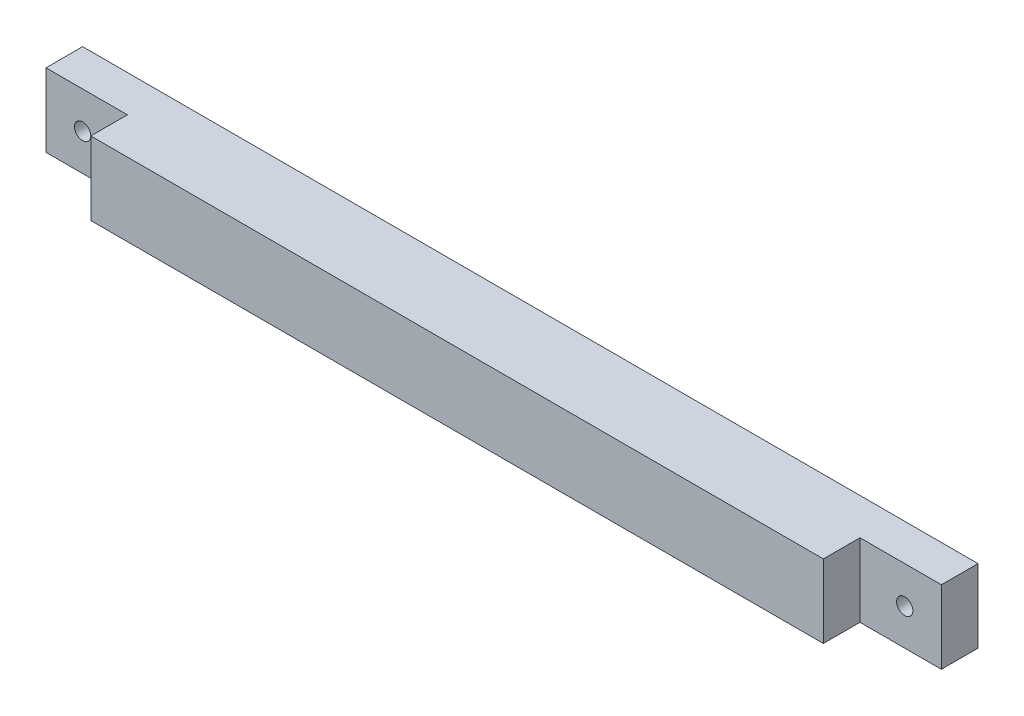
ISO-10303-21;
HEADER;
FILE_DESCRIPTION(('STEP AP214'),'2;1');
FILE_NAME('part.step','',(''),(''),'','','');
FILE_SCHEMA(('AUTOMOTIVE_DESIGN { 1 0 10303 214 1 1 1 1 }'));
ENDSEC;
DATA;
#1=APPLICATION_CONTEXT('core data for automotive mechanical design processes');
#2=APPLICATION_PROTOCOL_DEFINITION('international standard','automotive_design',2000,#1);
#3=PRODUCT_CONTEXT('',#1,'mechanical');
#4=PRODUCT('Part','Part','',(#3));
#5=PRODUCT_RELATED_PRODUCT_CATEGORY('part','',(#4));
#6=PRODUCT_DEFINITION_FORMATION('','',#4);
#7=PRODUCT_DEFINITION_CONTEXT('part definition',#1,'design');
#8=PRODUCT_DEFINITION('design','',#6,#7);
#9=PRODUCT_DEFINITION_SHAPE('','',#8);
#10=(LENGTH_UNIT() NAMED_UNIT(*) SI_UNIT(.MILLI.,.METRE.));
#11=(NAMED_UNIT(*) PLANE_ANGLE_UNIT() SI_UNIT($,.RADIAN.));
#12=(NAMED_UNIT(*) SI_UNIT($,.STERADIAN.) SOLID_ANGLE_UNIT());
#13=UNCERTAINTY_MEASURE_WITH_UNIT(LENGTH_MEASURE(1.E-05),#10,'distance_accuracy_value','');
#14=(GEOMETRIC_REPRESENTATION_CONTEXT(3) GLOBAL_UNCERTAINTY_ASSIGNED_CONTEXT((#13)) GLOBAL_UNIT_ASSIGNED_CONTEXT((#10,
#11,#12)) REPRESENTATION_CONTEXT('',''));
#15=CARTESIAN_POINT('',(0.,0.,0.));
#16=DIRECTION('',(0.,0.,1.));
#17=DIRECTION('',(1.,0.,0.));
#18=AXIS2_PLACEMENT_3D('',#15,#16,#17);
#19=CARTESIAN_POINT('',(42.7283154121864,-109.617562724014,9.));
#20=DIRECTION('',(-1.,0.,0.));
#21=DIRECTION('',(0.,0.,1.));
#22=AXIS2_PLACEMENT_3D('',#19,#20,#21);
#23=PLANE('',#22);
#24=DIRECTION('',(0.,1.,0.));
#25=VECTOR('',#24,1.);
#26=CARTESIAN_POINT('',(42.7283154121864,-109.617562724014,4.5));
#27=LINE('',#26,#25);
#28=CARTESIAN_POINT('',(42.7283154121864,-109.617562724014,4.5));
#29=VERTEX_POINT('',#28);
#30=CARTESIAN_POINT('',(42.7283154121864,-100.617562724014,4.5));
#31=VERTEX_POINT('',#30);
#32=EDGE_CURVE('E95',#29,#31,#27,.T.);
#33=ORIENTED_EDGE('',*,*,#32,.F.);
#34=DIRECTION('',(0.,0.,-1.));
#35=VECTOR('',#34,1.);
#36=CARTESIAN_POINT('',(42.7283154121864,-109.617562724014,9.));
#37=LINE('',#36,#35);
#38=CARTESIAN_POINT('',(42.7283154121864,-109.617562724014,0.));
#39=VERTEX_POINT('',#38);
#40=EDGE_CURVE('E38',#29,#39,#37,.T.);
#41=ORIENTED_EDGE('',*,*,#40,.T.);
#42=DIRECTION('',(0.,1.,0.));
#43=VECTOR('',#42,1.);
#44=CARTESIAN_POINT('',(42.7283154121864,-109.617562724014,0.));
#45=LINE('',#44,#43);
#46=CARTESIAN_POINT('',(42.7283154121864,-100.617562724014,0.));
#47=VERTEX_POINT('',#46);
#48=EDGE_CURVE('E116',#39,#47,#45,.T.);
#49=ORIENTED_EDGE('',*,*,#48,.T.);
#50=DIRECTION('',(0.,0.,-1.));
#51=VECTOR('',#50,1.);
#52=CARTESIAN_POINT('',(42.7283154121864,-100.617562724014,9.));
#53=LINE('',#52,#51);
#54=EDGE_CURVE('E111',#31,#47,#53,.T.);
#55=ORIENTED_EDGE('',*,*,#54,.F.);
#56=EDGE_LOOP('',(#33,#41,#49,#55));
#57=FACE_BOUND('',#56,.T.);
#58=ADVANCED_FACE('F30',(#57),#23,.F.);
#59=CARTESIAN_POINT('',(-67.2716845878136,-109.617562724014,9.));
#60=DIRECTION('',(1.,0.,0.));
#61=DIRECTION('',(0.,0.,-1.));
#62=AXIS2_PLACEMENT_3D('',#59,#60,#61);
#63=PLANE('',#62);
#64=DIRECTION('',(0.,0.,-1.));
#65=VECTOR('',#64,1.);
#66=CARTESIAN_POINT('',(-67.2716845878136,-109.617562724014,9.));
#67=LINE('',#66,#65);
#68=CARTESIAN_POINT('',(-67.2716845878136,-109.617562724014,4.5));
#69=VERTEX_POINT('',#68);
#70=CARTESIAN_POINT('',(-67.2716845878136,-109.617562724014,0.));
#71=VERTEX_POINT('',#70);
#72=EDGE_CURVE('E11',#69,#71,#67,.T.);
#73=ORIENTED_EDGE('',*,*,#72,.F.);
#74=DIRECTION('',(0.,-1.,0.));
#75=VECTOR('',#74,1.);
#76=CARTESIAN_POINT('',(-67.2716845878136,-109.617562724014,4.5));
#77=LINE('',#76,#75);
#78=CARTESIAN_POINT('',(-67.2716845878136,-100.617562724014,4.5));
#79=VERTEX_POINT('',#78);
#80=EDGE_CURVE('E143',#79,#69,#77,.T.);
#81=ORIENTED_EDGE('',*,*,#80,.F.);
#82=DIRECTION('',(0.,0.,-1.));
#83=VECTOR('',#82,1.);
#84=CARTESIAN_POINT('',(-67.2716845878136,-100.617562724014,9.));
#85=LINE('',#84,#83);
#86=CARTESIAN_POINT('',(-67.2716845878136,-100.617562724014,0.));
#87=VERTEX_POINT('',#86);
#88=EDGE_CURVE('E118',#79,#87,#85,.T.);
#89=ORIENTED_EDGE('',*,*,#88,.T.);
#90=DIRECTION('',(0.,-1.,0.));
#91=VECTOR('',#90,1.);
#92=CARTESIAN_POINT('',(-67.2716845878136,-109.617562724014,0.));
#93=LINE('',#92,#91);
#94=EDGE_CURVE('E130',#87,#71,#93,.T.);
#95=ORIENTED_EDGE('',*,*,#94,.T.);
#96=EDGE_LOOP('',(#73,#81,#89,#95));
#97=FACE_BOUND('',#96,.T.);
#98=ADVANCED_FACE('F32',(#97),#63,.F.);
#99=CARTESIAN_POINT('',(-67.2716845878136,-109.617562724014,9.));
#100=DIRECTION('',(0.,1.,0.));
#101=DIRECTION('',(0.,0.,1.));
#102=AXIS2_PLACEMENT_3D('',#99,#100,#101);
#103=PLANE('',#102);
#104=DIRECTION('',(1.,0.,0.));
#105=VECTOR('',#104,1.);
#106=CARTESIAN_POINT('',(42.7283154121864,-109.617562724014,4.5));
#107=LINE('',#106,#105);
#108=CARTESIAN_POINT('',(32.7283154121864,-109.617562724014,4.5));
#109=VERTEX_POINT('',#108);
#110=EDGE_CURVE('E101',#109,#29,#107,.T.);
#111=ORIENTED_EDGE('',*,*,#110,.F.);
#112=DIRECTION('',(0.,0.,1.));
#113=VECTOR('',#112,1.);
#114=CARTESIAN_POINT('',(32.7283154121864,-109.617562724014,4.5));
#115=LINE('',#114,#113);
#116=CARTESIAN_POINT('',(32.7283154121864,-109.617562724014,9.));
#117=VERTEX_POINT('',#116);
#118=EDGE_CURVE('E144',#109,#117,#115,.T.);
#119=ORIENTED_EDGE('',*,*,#118,.T.);
#120=DIRECTION('',(1.,0.,0.));
#121=VECTOR('',#120,1.);
#122=CARTESIAN_POINT('',(-67.2716845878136,-109.617562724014,9.));
#123=LINE('',#122,#121);
#124=CARTESIAN_POINT('',(-57.2716845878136,-109.617562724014,9.));
#125=VERTEX_POINT('',#124);
#126=EDGE_CURVE('E125',#125,#117,#123,.T.);
#127=ORIENTED_EDGE('',*,*,#126,.F.);
#128=DIRECTION('',(0.,0.,1.));
#129=VECTOR('',#128,1.);
#130=CARTESIAN_POINT('',(-57.2716845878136,-109.617562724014,4.5));
#131=LINE('',#130,#129);
#132=CARTESIAN_POINT('',(-57.2716845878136,-109.617562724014,4.5));
#133=VERTEX_POINT('',#132);
#134=EDGE_CURVE('E53',#133,#125,#131,.T.);
#135=ORIENTED_EDGE('',*,*,#134,.F.);
#136=DIRECTION('',(1.,0.,0.));
#137=VECTOR('',#136,1.);
#138=CARTESIAN_POINT('',(-67.2716845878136,-109.617562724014,4.5));
#139=LINE('',#138,#137);
#140=EDGE_CURVE('E149',#69,#133,#139,.T.);
#141=ORIENTED_EDGE('',*,*,#140,.F.);
#142=ORIENTED_EDGE('',*,*,#72,.T.);
#143=DIRECTION('',(1.,0.,0.));
#144=VECTOR('',#143,1.);
#145=CARTESIAN_POINT('',(-67.2716845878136,-109.617562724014,0.));
#146=LINE('',#145,#144);
#147=EDGE_CURVE('E127',#71,#39,#146,.T.);
#148=ORIENTED_EDGE('',*,*,#147,.T.);
#149=ORIENTED_EDGE('',*,*,#40,.F.);
#150=EDGE_LOOP('',(#111,#119,#127,#135,#141,#142,#148,#149));
#151=FACE_BOUND('',#150,.T.);
#152=ADVANCED_FACE('F195',(#151),#103,.F.);
#153=CARTESIAN_POINT('',(-67.2716845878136,-100.617562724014,9.));
#154=DIRECTION('',(0.,-1.,0.));
#155=DIRECTION('',(0.,0.,-1.));
#156=AXIS2_PLACEMENT_3D('',#153,#154,#155);
#157=PLANE('',#156);
#158=DIRECTION('',(-1.,0.,0.));
#159=VECTOR('',#158,1.);
#160=CARTESIAN_POINT('',(-67.2716845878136,-100.617562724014,9.));
#161=LINE('',#160,#159);
#162=CARTESIAN_POINT('',(32.7283154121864,-100.617562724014,9.));
#163=VERTEX_POINT('',#162);
#164=CARTESIAN_POINT('',(-57.2716845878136,-100.617562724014,9.));
#165=VERTEX_POINT('',#164);
#166=EDGE_CURVE('E120',#163,#165,#161,.T.);
#167=ORIENTED_EDGE('',*,*,#166,.F.);
#168=DIRECTION('',(0.,0.,1.));
#169=VECTOR('',#168,1.);
#170=CARTESIAN_POINT('',(32.7283154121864,-100.617562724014,4.5));
#171=LINE('',#170,#169);
#172=CARTESIAN_POINT('',(32.7283154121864,-100.617562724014,4.5));
#173=VERTEX_POINT('',#172);
#174=EDGE_CURVE('E45',#173,#163,#171,.T.);
#175=ORIENTED_EDGE('',*,*,#174,.F.);
#176=DIRECTION('',(-1.,0.,0.));
#177=VECTOR('',#176,1.);
#178=CARTESIAN_POINT('',(42.7283154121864,-100.617562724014,4.5));
#179=LINE('',#178,#177);
#180=EDGE_CURVE('E99',#31,#173,#179,.T.);
#181=ORIENTED_EDGE('',*,*,#180,.F.);
#182=ORIENTED_EDGE('',*,*,#54,.T.);
#183=DIRECTION('',(-1.,0.,0.));
#184=VECTOR('',#183,1.);
#185=CARTESIAN_POINT('',(-67.2716845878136,-100.617562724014,0.));
#186=LINE('',#185,#184);
#187=EDGE_CURVE('E123',#47,#87,#186,.T.);
#188=ORIENTED_EDGE('',*,*,#187,.T.);
#189=ORIENTED_EDGE('',*,*,#88,.F.);
#190=DIRECTION('',(-1.,0.,0.));
#191=VECTOR('',#190,1.);
#192=CARTESIAN_POINT('',(-67.2716845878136,-100.617562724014,4.5));
#193=LINE('',#192,#191);
#194=CARTESIAN_POINT('',(-57.2716845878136,-100.617562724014,4.5));
#195=VERTEX_POINT('',#194);
#196=EDGE_CURVE('E138',#195,#79,#193,.T.);
#197=ORIENTED_EDGE('',*,*,#196,.F.);
#198=DIRECTION('',(0.,0.,1.));
#199=VECTOR('',#198,1.);
#200=CARTESIAN_POINT('',(-57.2716845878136,-100.617562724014,4.5));
#201=LINE('',#200,#199);
#202=EDGE_CURVE('E133',#195,#165,#201,.T.);
#203=ORIENTED_EDGE('',*,*,#202,.T.);
#204=EDGE_LOOP('',(#167,#175,#181,#182,#188,#189,#197,#203));
#205=FACE_BOUND('',#204,.T.);
#206=ADVANCED_FACE('F109',(#205),#157,.F.);
#207=CARTESIAN_POINT('',(-67.2716845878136,-100.617562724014,9.));
#208=DIRECTION('',(0.,0.,-1.));
#209=DIRECTION('',(-1.,0.,0.));
#210=AXIS2_PLACEMENT_3D('',#207,#208,#209);
#211=PLANE('',#210);
#212=ORIENTED_EDGE('',*,*,#126,.T.);
#213=DIRECTION('',(0.,-1.,0.));
#214=VECTOR('',#213,1.);
#215=CARTESIAN_POINT('',(32.7283154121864,-109.617562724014,9.));
#216=LINE('',#215,#214);
#217=EDGE_CURVE('E105',#163,#117,#216,.T.);
#218=ORIENTED_EDGE('',*,*,#217,.F.);
#219=ORIENTED_EDGE('',*,*,#166,.T.);
#220=DIRECTION('',(0.,1.,0.));
#221=VECTOR('',#220,1.);
#222=CARTESIAN_POINT('',(-57.2716845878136,-109.617562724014,9.));
#223=LINE('',#222,#221);
#224=EDGE_CURVE('E141',#125,#165,#223,.T.);
#225=ORIENTED_EDGE('',*,*,#224,.F.);
#226=EDGE_LOOP('',(#212,#218,#219,#225));
#227=FACE_BOUND('',#226,.T.);
#228=ADVANCED_FACE('F201',(#227),#211,.F.);
#229=CARTESIAN_POINT('',(-67.2716845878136,-100.617562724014,0.));
#230=DIRECTION('',(0.,0.,-1.));
#231=DIRECTION('',(-1.,0.,0.));
#232=AXIS2_PLACEMENT_3D('',#229,#230,#231);
#233=PLANE('',#232);
#234=CARTESIAN_POINT('',(-62.7716845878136,-105.117562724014,0.));
#235=DIRECTION('',(0.,0.,1.));
#236=DIRECTION('',(1.,0.,0.));
#237=AXIS2_PLACEMENT_3D('',#234,#235,#236);
#238=CIRCLE('',#237,0.999999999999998);
#239=CARTESIAN_POINT('',(-61.7716845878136,-105.117562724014,0.));
#240=VERTEX_POINT('',#239);
#241=EDGE_CURVE('E163',#240,#240,#238,.T.);
#242=ORIENTED_EDGE('',*,*,#241,.T.);
#243=EDGE_LOOP('',(#242));
#244=FACE_BOUND('',#243,.T.);
#245=CARTESIAN_POINT('',(38.2284017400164,-105.145436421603,0.));
#246=DIRECTION('',(0.,0.,1.));
#247=DIRECTION('',(1.,0.,0.));
#248=AXIS2_PLACEMENT_3D('',#245,#246,#247);
#249=CIRCLE('',#248,0.999999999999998);
#250=CARTESIAN_POINT('',(39.2284017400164,-105.145436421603,0.));
#251=VERTEX_POINT('',#250);
#252=EDGE_CURVE('E157',#251,#251,#249,.T.);
#253=ORIENTED_EDGE('',*,*,#252,.T.);
#254=EDGE_LOOP('',(#253));
#255=FACE_BOUND('',#254,.T.);
#256=ORIENTED_EDGE('',*,*,#94,.F.);
#257=ORIENTED_EDGE('',*,*,#187,.F.);
#258=ORIENTED_EDGE('',*,*,#48,.F.);
#259=ORIENTED_EDGE('',*,*,#147,.F.);
#260=EDGE_LOOP('',(#256,#257,#258,#259));
#261=FACE_BOUND('',#260,.T.);
#262=ADVANCED_FACE('F172',(#244,#255,#261),#233,.T.);
#263=CARTESIAN_POINT('',(-57.2716845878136,-109.617562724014,4.5));
#264=DIRECTION('',(1.,0.,0.));
#265=DIRECTION('',(0.,1.,0.));
#266=AXIS2_PLACEMENT_3D('',#263,#264,#265);
#267=PLANE('',#266);
#268=ORIENTED_EDGE('',*,*,#224,.T.);
#269=ORIENTED_EDGE('',*,*,#202,.F.);
#270=DIRECTION('',(0.,1.,0.));
#271=VECTOR('',#270,1.);
#272=CARTESIAN_POINT('',(-57.2716845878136,-109.617562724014,4.5));
#273=LINE('',#272,#271);
#274=EDGE_CURVE('E146',#133,#195,#273,.T.);
#275=ORIENTED_EDGE('',*,*,#274,.F.);
#276=ORIENTED_EDGE('',*,*,#134,.T.);
#277=EDGE_LOOP('',(#268,#269,#275,#276));
#278=FACE_BOUND('',#277,.T.);
#279=ADVANCED_FACE('F186',(#278),#267,.F.);
#280=CARTESIAN_POINT('',(-67.2716845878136,-100.617562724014,4.5));
#281=DIRECTION('',(0.,0.,-1.));
#282=DIRECTION('',(-1.,0.,0.));
#283=AXIS2_PLACEMENT_3D('',#280,#281,#282);
#284=PLANE('',#283);
#285=CARTESIAN_POINT('',(-62.7716845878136,-105.117562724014,4.5));
#286=DIRECTION('',(0.,0.,1.));
#287=DIRECTION('',(1.,0.,0.));
#288=AXIS2_PLACEMENT_3D('',#285,#286,#287);
#289=CIRCLE('',#288,0.999999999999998);
#290=CARTESIAN_POINT('',(-61.7716845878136,-105.117562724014,4.5));
#291=VERTEX_POINT('',#290);
#292=EDGE_CURVE('E166',#291,#291,#289,.T.);
#293=ORIENTED_EDGE('',*,*,#292,.F.);
#294=EDGE_LOOP('',(#293));
#295=FACE_BOUND('',#294,.T.);
#296=ORIENTED_EDGE('',*,*,#80,.T.);
#297=ORIENTED_EDGE('',*,*,#140,.T.);
#298=ORIENTED_EDGE('',*,*,#274,.T.);
#299=ORIENTED_EDGE('',*,*,#196,.T.);
#300=EDGE_LOOP('',(#296,#297,#298,#299));
#301=FACE_BOUND('',#300,.T.);
#302=ADVANCED_FACE('F182',(#295,#301),#284,.F.);
#303=CARTESIAN_POINT('',(32.7283154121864,-109.617562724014,4.5));
#304=DIRECTION('',(-1.,0.,0.));
#305=DIRECTION('',(0.,0.,1.));
#306=AXIS2_PLACEMENT_3D('',#303,#304,#305);
#307=PLANE('',#306);
#308=ORIENTED_EDGE('',*,*,#217,.T.);
#309=ORIENTED_EDGE('',*,*,#118,.F.);
#310=DIRECTION('',(0.,-1.,0.));
#311=VECTOR('',#310,1.);
#312=CARTESIAN_POINT('',(32.7283154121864,-109.617562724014,4.5));
#313=LINE('',#312,#311);
#314=EDGE_CURVE('E113',#173,#109,#313,.T.);
#315=ORIENTED_EDGE('',*,*,#314,.F.);
#316=ORIENTED_EDGE('',*,*,#174,.T.);
#317=EDGE_LOOP('',(#308,#309,#315,#316));
#318=FACE_BOUND('',#317,.T.);
#319=ADVANCED_FACE('F185',(#318),#307,.F.);
#320=CARTESIAN_POINT('',(42.7283154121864,-100.617562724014,4.5));
#321=DIRECTION('',(0.,0.,1.));
#322=DIRECTION('',(1.,0.,0.));
#323=AXIS2_PLACEMENT_3D('',#320,#321,#322);
#324=PLANE('',#323);
#325=CARTESIAN_POINT('',(38.2284017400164,-105.145436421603,4.5));
#326=DIRECTION('',(0.,0.,1.));
#327=DIRECTION('',(1.,0.,0.));
#328=AXIS2_PLACEMENT_3D('',#325,#326,#327);
#329=CIRCLE('',#328,0.999999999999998);
#330=CARTESIAN_POINT('',(39.2284017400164,-105.145436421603,4.5));
#331=VERTEX_POINT('',#330);
#332=EDGE_CURVE('E160',#331,#331,#329,.T.);
#333=ORIENTED_EDGE('',*,*,#332,.F.);
#334=EDGE_LOOP('',(#333));
#335=FACE_BOUND('',#334,.T.);
#336=ORIENTED_EDGE('',*,*,#32,.T.);
#337=ORIENTED_EDGE('',*,*,#180,.T.);
#338=ORIENTED_EDGE('',*,*,#314,.T.);
#339=ORIENTED_EDGE('',*,*,#110,.T.);
#340=EDGE_LOOP('',(#336,#337,#338,#339));
#341=FACE_BOUND('',#340,.T.);
#342=ADVANCED_FACE('F97',(#335,#341),#324,.T.);
#343=CARTESIAN_POINT('',(38.2284017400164,-105.145436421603,0.));
#344=DIRECTION('',(0.,0.,1.));
#345=DIRECTION('',(1.,0.,0.));
#346=AXIS2_PLACEMENT_3D('',#343,#344,#345);
#347=CYLINDRICAL_SURFACE('',#346,0.999999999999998);
#348=ORIENTED_EDGE('',*,*,#252,.F.);
#349=EDGE_LOOP('',(#348));
#350=FACE_BOUND('',#349,.T.);
#351=ORIENTED_EDGE('',*,*,#332,.T.);
#352=EDGE_LOOP('',(#351));
#353=FACE_BOUND('',#352,.T.);
#354=ADVANCED_FACE('F178',(#350,#353),#347,.F.);
#355=CARTESIAN_POINT('',(-62.7716845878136,-105.117562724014,0.));
#356=DIRECTION('',(0.,0.,1.));
#357=DIRECTION('',(1.,0.,0.));
#358=AXIS2_PLACEMENT_3D('',#355,#356,#357);
#359=CYLINDRICAL_SURFACE('',#358,0.999999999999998);
#360=ORIENTED_EDGE('',*,*,#241,.F.);
#361=EDGE_LOOP('',(#360));
#362=FACE_BOUND('',#361,.T.);
#363=ORIENTED_EDGE('',*,*,#292,.T.);
#364=EDGE_LOOP('',(#363));
#365=FACE_BOUND('',#364,.T.);
#366=ADVANCED_FACE('F175',(#362,#365),#359,.F.);
#367=CLOSED_SHELL('',(#58,#98,#152,#206,#228,#262,#279,#302,#319,#342,#354,#366));
#368=MANIFOLD_SOLID_BREP('B2',#367);
#369=ADVANCED_BREP_SHAPE_REPRESENTATION('',(#18,#368),#14);
#370=SHAPE_DEFINITION_REPRESENTATION(#9,#369);
ENDSEC;
END-ISO-10303-21;
